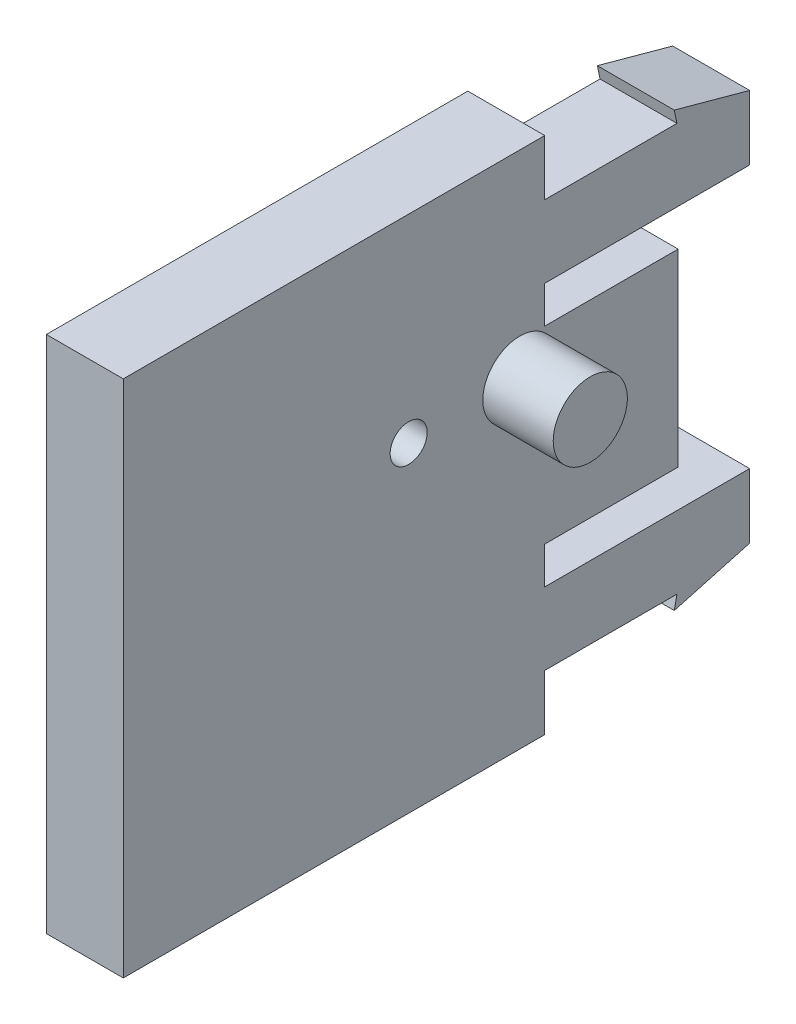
from build123d import *

# Parameters (mm, degrees)
EXTRUSION1_DEPTH        = 15
EXTRUSION1_DEPTH_BACK   = 1.9
ESQUISSE1_W             = 2.075683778
ESQUISSE1_H             = 14
ENL_V_MAT_EXTRU_3_DEPTH = 64.093727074
ESQUISSE3_R             = 1
EXTRUSION2_DEPTH        = 1.9
ESQUISSE4_R             = 1
EXTRUSION3_DEPTH        = 1.9
ESQUISSE5_R             = 0.5
ENL_V_MAT_EXTRU_4_DEPTH = 1
ESQUISSE6_R             = 0.5
ENL_V_MAT_EXTRU_5_DEPTH = 1


with BuildPart() as part:
    # Esquisse1 → Extrusion1 (new, two sides: drawn at the far end of the back side and taken through both)
    with BuildSketch(Plane.XY.offset(-EXTRUSION1_DEPTH_BACK)):
        with Locations((6.390921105, 54.24957088)):
            Rectangle(ESQUISSE1_W, ESQUISSE1_H)
    extrude(amount=EXTRUSION1_DEPTH + EXTRUSION1_DEPTH_BACK)

    # Esquisse2 → Enl_v. mat.-Extru.3 (cut, through all)
    with BuildSketch(Plane(origin=(7.428762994, 0, 0), x_dir=(0, 0, -1), z_dir=(1, 0, 0))):
        Polygon((3.910773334, 47.24957088), (-0.037399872, 47.24957088), (-3.628578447, 47.24957088), (-3.628578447, 48.74957088), (-0.06127016, 48.74957088), (-0.133819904, 48.402868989), (2.312788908, 49.072927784), (2.312788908, 50.702868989), (-3.628578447, 50.702868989), (-3.628578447, 51.702868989), (-0.028578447, 51.702868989), (-0.028578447, 56.796272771), (-3.628578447, 56.796272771), (-3.628578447, 57.796272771), (2.312788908, 57.796272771), (2.312788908, 59.426213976), (-0.133819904, 60.096272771), (-0.06127016, 59.74957088), (-3.628578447, 59.74957088), (-3.628578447, 61.24957088), (-0.037399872, 61.24957088), (3.910773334, 61.24957088), align=None)
    extrude(amount=-ENL_V_MAT_EXTRU_3_DEPTH, mode=Mode.SUBTRACT)

    # Esquisse3 → Extrusion2 (add)
    with BuildSketch(Plane(origin=(7.428762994, 0, 0), x_dir=(0, 0, -1), z_dir=(1, 0, 0))):
        with Locations(Location((-4.3, 55.89957088, 0), (0, 0, 180))):
            Circle(ESQUISSE3_R)
    extrude(amount=EXTRUSION2_DEPTH)

    # Esquisse4 → Extrusion3 (add)
    with BuildSketch(Plane.ZY.offset(-5.353079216)):
        with Locations(Location((12.1, 55.99957088, 0), (0, 0, 180))):
            Circle(ESQUISSE4_R)
    extrude(amount=EXTRUSION3_DEPTH)

    # Esquisse5 → Enl_v. mat.-Extru.4 (cut)
    with BuildSketch(Plane.ZY.offset(-5.353079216)):
        with Locations((9.1, 55.999570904)):
            Circle(ESQUISSE5_R)
    extrude(amount=-ENL_V_MAT_EXTRU_4_DEPTH, mode=Mode.SUBTRACT)

    # Esquisse6 → Enl_v. mat.-Extru.5 (cut)
    with BuildSketch(Plane(origin=(7.428762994, 0, 0), x_dir=(0, 0, -1), z_dir=(1, 0, 0))):
        with Locations((-7.3, 55.899570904)):
            Circle(ESQUISSE6_R)
    extrude(amount=-ENL_V_MAT_EXTRU_5_DEPTH, mode=Mode.SUBTRACT)


solid = part.part
